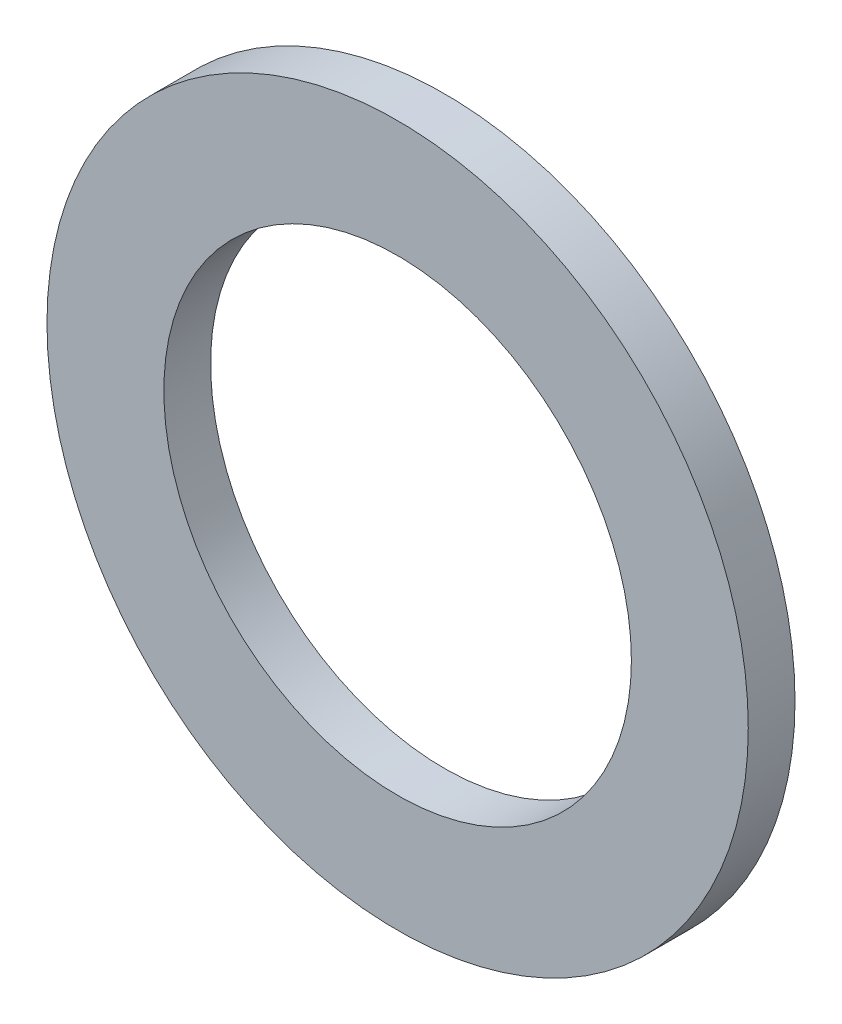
ISO-10303-21;
HEADER;
FILE_DESCRIPTION(('STEP AP214'),'2;1');
FILE_NAME('part.step','',(''),(''),'','','');
FILE_SCHEMA(('AUTOMOTIVE_DESIGN { 1 0 10303 214 1 1 1 1 }'));
ENDSEC;
DATA;
#1=APPLICATION_CONTEXT('core data for automotive mechanical design processes');
#2=APPLICATION_PROTOCOL_DEFINITION('international standard','automotive_design',2000,#1);
#3=PRODUCT_CONTEXT('',#1,'mechanical');
#4=PRODUCT('Part','Part','',(#3));
#5=PRODUCT_RELATED_PRODUCT_CATEGORY('part','',(#4));
#6=PRODUCT_DEFINITION_FORMATION('','',#4);
#7=PRODUCT_DEFINITION_CONTEXT('part definition',#1,'design');
#8=PRODUCT_DEFINITION('design','',#6,#7);
#9=PRODUCT_DEFINITION_SHAPE('','',#8);
#10=(LENGTH_UNIT() NAMED_UNIT(*) SI_UNIT(.MILLI.,.METRE.));
#11=(NAMED_UNIT(*) PLANE_ANGLE_UNIT() SI_UNIT($,.RADIAN.));
#12=(NAMED_UNIT(*) SI_UNIT($,.STERADIAN.) SOLID_ANGLE_UNIT());
#13=UNCERTAINTY_MEASURE_WITH_UNIT(LENGTH_MEASURE(1.E-05),#10,'distance_accuracy_value','');
#14=(GEOMETRIC_REPRESENTATION_CONTEXT(3) GLOBAL_UNCERTAINTY_ASSIGNED_CONTEXT((#13)) GLOBAL_UNIT_ASSIGNED_CONTEXT((#10,
#11,#12)) REPRESENTATION_CONTEXT('',''));
#15=CARTESIAN_POINT('',(0.,0.,0.));
#16=DIRECTION('',(0.,0.,1.));
#17=DIRECTION('',(1.,0.,0.));
#18=AXIS2_PLACEMENT_3D('',#15,#16,#17);
#19=CARTESIAN_POINT('',(0.,0.,2.));
#20=DIRECTION('',(0.,0.,1.));
#21=DIRECTION('',(1.,0.,0.));
#22=AXIS2_PLACEMENT_3D('',#19,#20,#21);
#23=PLANE('',#22);
#24=CARTESIAN_POINT('',(0.,0.,2.));
#25=DIRECTION('',(0.,0.,1.));
#26=DIRECTION('',(1.,0.,0.));
#27=AXIS2_PLACEMENT_3D('',#24,#25,#26);
#28=CIRCLE('',#27,15.);
#29=CARTESIAN_POINT('',(15.,0.,2.));
#30=VERTEX_POINT('',#29);
#31=EDGE_CURVE('E10',#30,#30,#28,.T.);
#32=ORIENTED_EDGE('',*,*,#31,.T.);
#33=EDGE_LOOP('',(#32));
#34=FACE_BOUND('',#33,.T.);
#35=CARTESIAN_POINT('',(0.,0.,2.));
#36=DIRECTION('',(0.,0.,1.));
#37=DIRECTION('',(1.,0.,0.));
#38=AXIS2_PLACEMENT_3D('',#35,#36,#37);
#39=CIRCLE('',#38,10.);
#40=CARTESIAN_POINT('',(10.,0.,2.));
#41=VERTEX_POINT('',#40);
#42=EDGE_CURVE('E44',#41,#41,#39,.T.);
#43=ORIENTED_EDGE('',*,*,#42,.F.);
#44=EDGE_LOOP('',(#43));
#45=FACE_BOUND('',#44,.T.);
#46=ADVANCED_FACE('F33',(#34,#45),#23,.T.);
#47=CARTESIAN_POINT('',(0.,0.,0.));
#48=DIRECTION('',(0.,0.,1.));
#49=DIRECTION('',(1.,0.,0.));
#50=AXIS2_PLACEMENT_3D('',#47,#48,#49);
#51=PLANE('',#50);
#52=CARTESIAN_POINT('',(0.,0.,0.));
#53=DIRECTION('',(0.,0.,1.));
#54=DIRECTION('',(1.,0.,0.));
#55=AXIS2_PLACEMENT_3D('',#52,#53,#54);
#56=CIRCLE('',#55,15.);
#57=CARTESIAN_POINT('',(15.,0.,0.));
#58=VERTEX_POINT('',#57);
#59=EDGE_CURVE('E40',#58,#58,#56,.T.);
#60=ORIENTED_EDGE('',*,*,#59,.F.);
#61=EDGE_LOOP('',(#60));
#62=FACE_BOUND('',#61,.T.);
#63=CARTESIAN_POINT('',(0.,0.,0.));
#64=DIRECTION('',(0.,0.,1.));
#65=DIRECTION('',(1.,0.,0.));
#66=AXIS2_PLACEMENT_3D('',#63,#64,#65);
#67=CIRCLE('',#66,10.);
#68=CARTESIAN_POINT('',(10.,0.,0.));
#69=VERTEX_POINT('',#68);
#70=EDGE_CURVE('E48',#69,#69,#67,.T.);
#71=ORIENTED_EDGE('',*,*,#70,.T.);
#72=EDGE_LOOP('',(#71));
#73=FACE_BOUND('',#72,.T.);
#74=ADVANCED_FACE('F54',(#62,#73),#51,.F.);
#75=CARTESIAN_POINT('',(0.,0.,2.));
#76=DIRECTION('',(0.,0.,-1.));
#77=DIRECTION('',(-1.,0.,0.));
#78=AXIS2_PLACEMENT_3D('',#75,#76,#77);
#79=CYLINDRICAL_SURFACE('',#78,15.);
#80=ORIENTED_EDGE('',*,*,#31,.F.);
#81=EDGE_LOOP('',(#80));
#82=FACE_BOUND('',#81,.T.);
#83=ORIENTED_EDGE('',*,*,#59,.T.);
#84=EDGE_LOOP('',(#83));
#85=FACE_BOUND('',#84,.T.);
#86=ADVANCED_FACE('F35',(#82,#85),#79,.T.);
#87=CARTESIAN_POINT('',(0.,0.,2.));
#88=DIRECTION('',(0.,0.,-1.));
#89=DIRECTION('',(-1.,0.,0.));
#90=AXIS2_PLACEMENT_3D('',#87,#88,#89);
#91=CYLINDRICAL_SURFACE('',#90,10.);
#92=ORIENTED_EDGE('',*,*,#42,.T.);
#93=EDGE_LOOP('',(#92));
#94=FACE_BOUND('',#93,.T.);
#95=ORIENTED_EDGE('',*,*,#70,.F.);
#96=EDGE_LOOP('',(#95));
#97=FACE_BOUND('',#96,.T.);
#98=ADVANCED_FACE('F56',(#94,#97),#91,.F.);
#99=CLOSED_SHELL('',(#46,#74,#86,#98));
#100=MANIFOLD_SOLID_BREP('B2',#99);
#101=ADVANCED_BREP_SHAPE_REPRESENTATION('',(#18,#100),#14);
#102=SHAPE_DEFINITION_REPRESENTATION(#9,#101);
ENDSEC;
END-ISO-10303-21;
